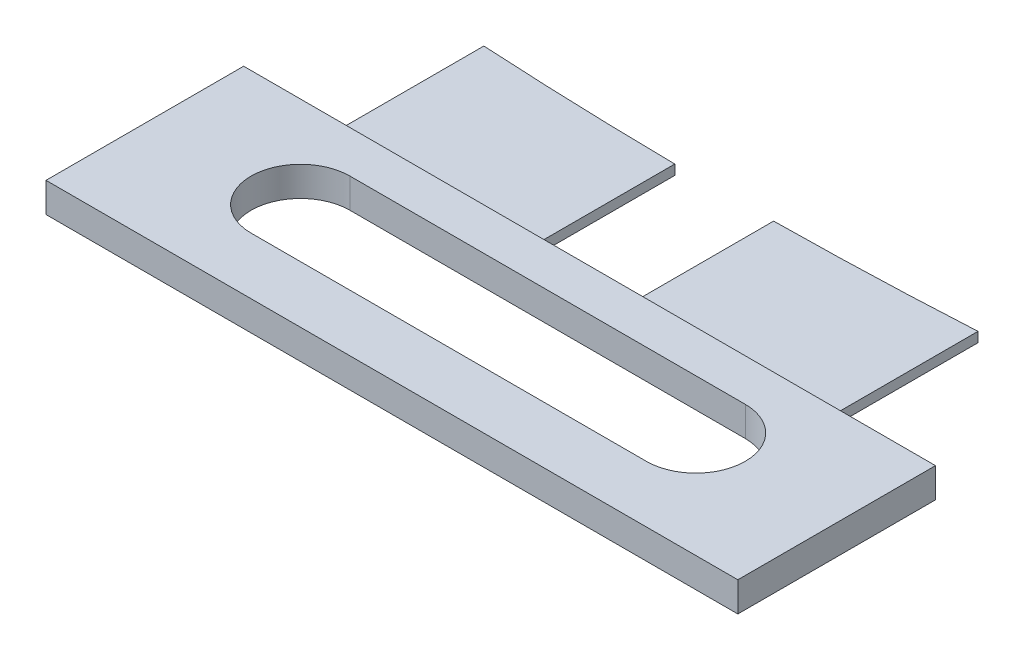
ISO-10303-21;
HEADER;
FILE_DESCRIPTION(('STEP AP214'),'2;1');
FILE_NAME('part.step','',(''),(''),'','','');
FILE_SCHEMA(('AUTOMOTIVE_DESIGN { 1 0 10303 214 1 1 1 1 }'));
ENDSEC;
DATA;
#1=APPLICATION_CONTEXT('core data for automotive mechanical design processes');
#2=APPLICATION_PROTOCOL_DEFINITION('international standard','automotive_design',2000,#1);
#3=PRODUCT_CONTEXT('',#1,'mechanical');
#4=PRODUCT('Part','Part','',(#3));
#5=PRODUCT_RELATED_PRODUCT_CATEGORY('part','',(#4));
#6=PRODUCT_DEFINITION_FORMATION('','',#4);
#7=PRODUCT_DEFINITION_CONTEXT('part definition',#1,'design');
#8=PRODUCT_DEFINITION('design','',#6,#7);
#9=PRODUCT_DEFINITION_SHAPE('','',#8);
#10=(LENGTH_UNIT() NAMED_UNIT(*) SI_UNIT(.MILLI.,.METRE.));
#11=(NAMED_UNIT(*) PLANE_ANGLE_UNIT() SI_UNIT($,.RADIAN.));
#12=(NAMED_UNIT(*) SI_UNIT($,.STERADIAN.) SOLID_ANGLE_UNIT());
#13=UNCERTAINTY_MEASURE_WITH_UNIT(LENGTH_MEASURE(1.E-05),#10,'distance_accuracy_value','');
#14=(GEOMETRIC_REPRESENTATION_CONTEXT(3) GLOBAL_UNCERTAINTY_ASSIGNED_CONTEXT((#13)) GLOBAL_UNIT_ASSIGNED_CONTEXT((#10,
#11,#12)) REPRESENTATION_CONTEXT('',''));
#15=CARTESIAN_POINT('',(0.,0.,0.));
#16=DIRECTION('',(0.,0.,1.));
#17=DIRECTION('',(1.,0.,0.));
#18=AXIS2_PLACEMENT_3D('',#15,#16,#17);
#19=CARTESIAN_POINT('',(25.,0.,25.7005587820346));
#20=CARTESIAN_POINT('',(25.,-0.333333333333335,25.7005587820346));
#21=CARTESIAN_POINT('',(25.0000000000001,-0.666666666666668,25.7005587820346));
#22=CARTESIAN_POINT('',(25.0000000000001,-1.,25.7005587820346));
#23=CARTESIAN_POINT('',(18.3078555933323,0.,26.0801202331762));
#24=CARTESIAN_POINT('',(18.3078555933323,-0.333333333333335,26.0801202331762));
#25=CARTESIAN_POINT('',(18.3078555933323,-0.666666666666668,26.0801202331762));
#26=CARTESIAN_POINT('',(18.3078555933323,-1.,26.0801202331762));
#27=CARTESIAN_POINT('',(11.7024739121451,0.,26.3045502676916));
#28=CARTESIAN_POINT('',(11.7024739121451,-0.333333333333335,26.3045502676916));
#29=CARTESIAN_POINT('',(11.7024739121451,-0.666666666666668,26.3045502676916));
#30=CARTESIAN_POINT('',(11.7024739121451,-1.,26.3045502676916));
#31=CARTESIAN_POINT('',(4.9999999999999,0.,26.3800956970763));
#32=CARTESIAN_POINT('',(4.99999999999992,-0.333333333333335,26.3800956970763));
#33=CARTESIAN_POINT('',(4.99999999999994,-0.666666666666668,26.3800956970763));
#34=CARTESIAN_POINT('',(4.99999999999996,-1.,26.3800956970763));
#35=B_SPLINE_SURFACE_WITH_KNOTS('',3,3,((#19,#20,#21,#22),(#23,#24,#25,#26),(#27,#28,#29,#30),
(#31,#32,#33,#34)),.UNSPECIFIED.,.F.,.F.,.F.,(4,4),(4,4),(0.,1.),(0.,1.),.UNSPECIFIED.);
#36=CARTESIAN_POINT('',(4.9999999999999,0.,26.3800956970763));
#37=CARTESIAN_POINT('',(11.7024739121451,0.,26.3045502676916));
#38=CARTESIAN_POINT('',(18.3078555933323,0.,26.0801202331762));
#39=CARTESIAN_POINT('',(25.,0.,25.7005587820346));
#40=B_SPLINE_CURVE_WITH_KNOTS('',3,(#36,#37,#38,#39),.UNSPECIFIED.,.F.,.F.,(4,4),(0.,1.),.UNSPECIFIED.);
#41=CARTESIAN_POINT('',(25.,0.,25.7005587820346));
#42=VERTEX_POINT('',#41);
#43=CARTESIAN_POINT('',(4.99999999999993,0.,26.3800956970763));
#44=VERTEX_POINT('',#43);
#45=EDGE_CURVE('E339',#42,#44,#40,.F.);
#46=DIRECTION('',(0.,-1.,0.));
#47=VECTOR('',#46,1.);
#48=CARTESIAN_POINT('',(25.,4.61643110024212,25.7005587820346));
#49=LINE('',#48,#47);
#50=CARTESIAN_POINT('',(25.,-1.,25.7005587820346));
#51=VERTEX_POINT('',#50);
#52=EDGE_CURVE('E365',#51,#42,#49,.F.);
#53=CARTESIAN_POINT('',(25.0000000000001,-1.,25.7005587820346));
#54=CARTESIAN_POINT('',(18.3078555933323,-1.,26.0801202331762));
#55=CARTESIAN_POINT('',(11.7024739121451,-1.,26.3045502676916));
#56=CARTESIAN_POINT('',(4.99999999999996,-1.,26.3800956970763));
#57=B_SPLINE_CURVE_WITH_KNOTS('',3,(#53,#54,#55,#56),.UNSPECIFIED.,.F.,.F.,(4,4),(0.,1.),.UNSPECIFIED.);
#58=CARTESIAN_POINT('',(4.99999999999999,-1.,26.3800956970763));
#59=VERTEX_POINT('',#58);
#60=EDGE_CURVE('E368',#59,#51,#57,.F.);
#61=DIRECTION('',(0.,-1.,0.));
#62=VECTOR('',#61,1.);
#63=CARTESIAN_POINT('',(4.99999999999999,4.61643110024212,26.3800956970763));
#64=LINE('',#63,#62);
#65=EDGE_CURVE('E367',#44,#59,#64,.T.);
#66=ORIENTED_EDGE('',*,*,#45,.F.);
#67=ORIENTED_EDGE('',*,*,#52,.F.);
#68=ORIENTED_EDGE('',*,*,#60,.F.);
#69=ORIENTED_EDGE('',*,*,#65,.F.);
#70=EDGE_LOOP('',(#66,#67,#68,#69));
#71=FACE_BOUND('',#70,.T.);
#72=ADVANCED_FACE('F32',(#71),#35,.F.);
#73=CARTESIAN_POINT('',(4.99999999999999,-1.,-37.5014306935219));
#74=DIRECTION('',(-1.,0.,0.));
#75=DIRECTION('',(0.,0.,1.));
#76=AXIS2_PLACEMENT_3D('',#73,#74,#75);
#77=PLANE('',#76);
#78=ORIENTED_EDGE('',*,*,#65,.T.);
#79=DIRECTION('',(0.,0.,1.));
#80=VECTOR('',#79,1.);
#81=CARTESIAN_POINT('',(4.99999999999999,-1.,-37.5014306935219));
#82=LINE('',#81,#80);
#83=CARTESIAN_POINT('',(4.99999999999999,-1.,40.));
#84=VERTEX_POINT('',#83);
#85=EDGE_CURVE('E419',#59,#84,#82,.T.);
#86=ORIENTED_EDGE('',*,*,#85,.T.);
#87=DIRECTION('',(0.,-1.,0.));
#88=VECTOR('',#87,1.);
#89=CARTESIAN_POINT('',(4.99999999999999,-1.,40.));
#90=LINE('',#89,#88);
#91=CARTESIAN_POINT('',(4.99999999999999,0.,40.));
#92=VERTEX_POINT('',#91);
#93=EDGE_CURVE('E338',#92,#84,#90,.T.);
#94=ORIENTED_EDGE('',*,*,#93,.F.);
#95=DIRECTION('',(0.,0.,1.));
#96=VECTOR('',#95,1.);
#97=CARTESIAN_POINT('',(4.99999999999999,0.,-37.5014306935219));
#98=LINE('',#97,#96);
#99=EDGE_CURVE('E348',#44,#92,#98,.T.);
#100=ORIENTED_EDGE('',*,*,#99,.F.);
#101=EDGE_LOOP('',(#78,#86,#94,#100));
#102=FACE_BOUND('',#101,.T.);
#103=ADVANCED_FACE('F310',(#102),#77,.T.);
#104=CARTESIAN_POINT('',(25.,-1.,-37.5014306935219));
#105=DIRECTION('',(0.,-1.,0.));
#106=DIRECTION('',(0.,0.,-1.));
#107=AXIS2_PLACEMENT_3D('',#104,#105,#106);
#108=PLANE('',#107);
#109=ORIENTED_EDGE('',*,*,#60,.T.);
#110=DIRECTION('',(0.,0.,1.));
#111=VECTOR('',#110,1.);
#112=CARTESIAN_POINT('',(25.,-1.,-37.5014306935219));
#113=LINE('',#112,#111);
#114=CARTESIAN_POINT('',(25.,-1.,40.));
#115=VERTEX_POINT('',#114);
#116=EDGE_CURVE('E43',#51,#115,#113,.T.);
#117=ORIENTED_EDGE('',*,*,#116,.T.);
#118=DIRECTION('',(1.,0.,0.));
#119=VECTOR('',#118,1.);
#120=CARTESIAN_POINT('',(25.,-1.,40.));
#121=LINE('',#120,#119);
#122=EDGE_CURVE('E342',#84,#115,#121,.T.);
#123=ORIENTED_EDGE('',*,*,#122,.F.);
#124=ORIENTED_EDGE('',*,*,#85,.F.);
#125=EDGE_LOOP('',(#109,#117,#123,#124));
#126=FACE_BOUND('',#125,.T.);
#127=ADVANCED_FACE('F423',(#126),#108,.T.);
#128=CARTESIAN_POINT('',(25.,0.,-37.5014306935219));
#129=DIRECTION('',(1.,0.,0.));
#130=DIRECTION('',(0.,1.,0.));
#131=AXIS2_PLACEMENT_3D('',#128,#129,#130);
#132=PLANE('',#131);
#133=ORIENTED_EDGE('',*,*,#52,.T.);
#134=DIRECTION('',(0.,0.,1.));
#135=VECTOR('',#134,1.);
#136=CARTESIAN_POINT('',(25.,0.,-37.5014306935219));
#137=LINE('',#136,#135);
#138=CARTESIAN_POINT('',(25.,0.,40.));
#139=VERTEX_POINT('',#138);
#140=EDGE_CURVE('E11',#42,#139,#137,.T.);
#141=ORIENTED_EDGE('',*,*,#140,.T.);
#142=DIRECTION('',(0.,1.,0.));
#143=VECTOR('',#142,1.);
#144=CARTESIAN_POINT('',(25.,0.,40.));
#145=LINE('',#144,#143);
#146=EDGE_CURVE('E345',#115,#139,#145,.T.);
#147=ORIENTED_EDGE('',*,*,#146,.F.);
#148=ORIENTED_EDGE('',*,*,#116,.F.);
#149=EDGE_LOOP('',(#133,#141,#147,#148));
#150=FACE_BOUND('',#149,.T.);
#151=ADVANCED_FACE('F312',(#150),#132,.T.);
#152=CARTESIAN_POINT('',(4.99999999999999,0.,-37.5014306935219));
#153=DIRECTION('',(0.,1.,0.));
#154=DIRECTION('',(-1.,0.,0.));
#155=AXIS2_PLACEMENT_3D('',#152,#153,#154);
#156=PLANE('',#155);
#157=ORIENTED_EDGE('',*,*,#45,.T.);
#158=ORIENTED_EDGE('',*,*,#99,.T.);
#159=DIRECTION('',(-1.,0.,0.));
#160=VECTOR('',#159,1.);
#161=CARTESIAN_POINT('',(4.99999999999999,0.,40.));
#162=LINE('',#161,#160);
#163=EDGE_CURVE('E330',#139,#92,#162,.T.);
#164=ORIENTED_EDGE('',*,*,#163,.F.);
#165=ORIENTED_EDGE('',*,*,#140,.F.);
#166=EDGE_LOOP('',(#157,#158,#164,#165));
#167=FACE_BOUND('',#166,.T.);
#168=ADVANCED_FACE('F34',(#167),#156,.T.);
#169=CARTESIAN_POINT('',(-35.,0.382289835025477,60.));
#170=DIRECTION('',(1.,0.,0.));
#171=DIRECTION('',(0.,0.,-1.));
#172=AXIS2_PLACEMENT_3D('',#169,#170,#171);
#173=PLANE('',#172);
#174=DIRECTION('',(0.,-1.,0.));
#175=VECTOR('',#174,1.);
#176=CARTESIAN_POINT('',(-35.,0.382289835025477,40.));
#177=LINE('',#176,#175);
#178=CARTESIAN_POINT('',(-35.,0.382289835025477,40.));
#179=VERTEX_POINT('',#178);
#180=CARTESIAN_POINT('',(-35.,-2.61771016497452,40.));
#181=VERTEX_POINT('',#180);
#182=EDGE_CURVE('E259',#179,#181,#177,.T.);
#183=ORIENTED_EDGE('',*,*,#182,.T.);
#184=DIRECTION('',(0.,0.,-1.));
#185=VECTOR('',#184,1.);
#186=CARTESIAN_POINT('',(-35.,-2.61771016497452,60.));
#187=LINE('',#186,#185);
#188=CARTESIAN_POINT('',(-35.,-2.61771016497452,60.));
#189=VERTEX_POINT('',#188);
#190=EDGE_CURVE('E370',#189,#181,#187,.T.);
#191=ORIENTED_EDGE('',*,*,#190,.F.);
#192=DIRECTION('',(0.,-1.,0.));
#193=VECTOR('',#192,1.);
#194=CARTESIAN_POINT('',(-35.,0.382289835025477,60.));
#195=LINE('',#194,#193);
#196=CARTESIAN_POINT('',(-35.,0.382289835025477,60.));
#197=VERTEX_POINT('',#196);
#198=EDGE_CURVE('E272',#197,#189,#195,.T.);
#199=ORIENTED_EDGE('',*,*,#198,.F.);
#200=DIRECTION('',(0.,0.,-1.));
#201=VECTOR('',#200,1.);
#202=CARTESIAN_POINT('',(-35.,0.382289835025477,60.));
#203=LINE('',#202,#201);
#204=EDGE_CURVE('E386',#197,#179,#203,.T.);
#205=ORIENTED_EDGE('',*,*,#204,.T.);
#206=EDGE_LOOP('',(#183,#191,#199,#205));
#207=FACE_BOUND('',#206,.T.);
#208=ADVANCED_FACE('F301',(#207),#173,.F.);
#209=CARTESIAN_POINT('',(-35.,-2.61771016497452,60.));
#210=DIRECTION('',(0.,1.,0.));
#211=DIRECTION('',(0.,0.,1.));
#212=AXIS2_PLACEMENT_3D('',#209,#210,#211);
#213=PLANE('',#212);
#214=DIRECTION('',(-1.,0.,0.));
#215=VECTOR('',#214,1.);
#216=CARTESIAN_POINT('',(-20.,-2.61771016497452,44.2497229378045));
#217=LINE('',#216,#215);
#218=CARTESIAN_POINT('',(20.,-2.61771016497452,44.2497229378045));
#219=VERTEX_POINT('',#218);
#220=CARTESIAN_POINT('',(-20.,-2.61771016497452,44.2497229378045));
#221=VERTEX_POINT('',#220);
#222=EDGE_CURVE('E156',#219,#221,#217,.T.);
#223=ORIENTED_EDGE('',*,*,#222,.T.);
#224=CARTESIAN_POINT('',(-20.,-2.61771016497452,49.2497229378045));
#225=DIRECTION('',(0.,1.,0.));
#226=DIRECTION('',(0.,0.,1.));
#227=AXIS2_PLACEMENT_3D('',#224,#225,#226);
#228=CIRCLE('',#227,5.);
#229=CARTESIAN_POINT('',(-20.,-2.61771016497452,54.2497229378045));
#230=VERTEX_POINT('',#229);
#231=EDGE_CURVE('E150',#221,#230,#228,.T.);
#232=ORIENTED_EDGE('',*,*,#231,.T.);
#233=DIRECTION('',(1.,0.,0.));
#234=VECTOR('',#233,1.);
#235=CARTESIAN_POINT('',(-20.,-2.61771016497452,54.2497229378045));
#236=LINE('',#235,#234);
#237=CARTESIAN_POINT('',(20.,-2.61771016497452,54.2497229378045));
#238=VERTEX_POINT('',#237);
#239=EDGE_CURVE('E159',#230,#238,#236,.T.);
#240=ORIENTED_EDGE('',*,*,#239,.T.);
#241=CARTESIAN_POINT('',(20.,-2.61771016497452,49.2497229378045));
#242=DIRECTION('',(0.,1.,0.));
#243=DIRECTION('',(0.,0.,1.));
#244=AXIS2_PLACEMENT_3D('',#241,#242,#243);
#245=CIRCLE('',#244,5.);
#246=EDGE_CURVE('E51',#238,#219,#245,.T.);
#247=ORIENTED_EDGE('',*,*,#246,.T.);
#248=EDGE_LOOP('',(#223,#232,#240,#247));
#249=FACE_BOUND('',#248,.T.);
#250=DIRECTION('',(1.,0.,0.));
#251=VECTOR('',#250,1.);
#252=CARTESIAN_POINT('',(-35.,-2.61771016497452,40.));
#253=LINE('',#252,#251);
#254=CARTESIAN_POINT('',(35.,-2.61771016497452,40.));
#255=VERTEX_POINT('',#254);
#256=EDGE_CURVE('E394',#181,#255,#253,.T.);
#257=ORIENTED_EDGE('',*,*,#256,.T.);
#258=DIRECTION('',(0.,0.,-1.));
#259=VECTOR('',#258,1.);
#260=CARTESIAN_POINT('',(35.,-2.61771016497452,60.));
#261=LINE('',#260,#259);
#262=CARTESIAN_POINT('',(35.,-2.61771016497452,60.));
#263=VERTEX_POINT('',#262);
#264=EDGE_CURVE('E373',#263,#255,#261,.T.);
#265=ORIENTED_EDGE('',*,*,#264,.F.);
#266=DIRECTION('',(1.,0.,0.));
#267=VECTOR('',#266,1.);
#268=CARTESIAN_POINT('',(-35.,-2.61771016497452,60.));
#269=LINE('',#268,#267);
#270=EDGE_CURVE('E400',#189,#263,#269,.T.);
#271=ORIENTED_EDGE('',*,*,#270,.F.);
#272=ORIENTED_EDGE('',*,*,#190,.T.);
#273=EDGE_LOOP('',(#257,#265,#271,#272));
#274=FACE_BOUND('',#273,.T.);
#275=ADVANCED_FACE('F163',(#249,#274),#213,.F.);
#276=CARTESIAN_POINT('',(35.,0.382289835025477,60.));
#277=DIRECTION('',(-1.,0.,0.));
#278=DIRECTION('',(0.,0.,1.));
#279=AXIS2_PLACEMENT_3D('',#276,#277,#278);
#280=PLANE('',#279);
#281=DIRECTION('',(0.,1.,0.));
#282=VECTOR('',#281,1.);
#283=CARTESIAN_POINT('',(35.,0.382289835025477,40.));
#284=LINE('',#283,#282);
#285=CARTESIAN_POINT('',(35.,0.382289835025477,40.));
#286=VERTEX_POINT('',#285);
#287=EDGE_CURVE('E392',#255,#286,#284,.T.);
#288=ORIENTED_EDGE('',*,*,#287,.T.);
#289=DIRECTION('',(0.,0.,-1.));
#290=VECTOR('',#289,1.);
#291=CARTESIAN_POINT('',(35.,0.382289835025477,60.));
#292=LINE('',#291,#290);
#293=CARTESIAN_POINT('',(35.,0.382289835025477,60.));
#294=VERTEX_POINT('',#293);
#295=EDGE_CURVE('E383',#294,#286,#292,.T.);
#296=ORIENTED_EDGE('',*,*,#295,.F.);
#297=DIRECTION('',(0.,1.,0.));
#298=VECTOR('',#297,1.);
#299=CARTESIAN_POINT('',(35.,0.382289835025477,60.));
#300=LINE('',#299,#298);
#301=EDGE_CURVE('E399',#263,#294,#300,.T.);
#302=ORIENTED_EDGE('',*,*,#301,.F.);
#303=ORIENTED_EDGE('',*,*,#264,.T.);
#304=EDGE_LOOP('',(#288,#296,#302,#303));
#305=FACE_BOUND('',#304,.T.);
#306=ADVANCED_FACE('F294',(#305),#280,.F.);
#307=CARTESIAN_POINT('',(-35.,0.382289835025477,60.));
#308=DIRECTION('',(0.,-1.,0.));
#309=DIRECTION('',(0.,0.,-1.));
#310=AXIS2_PLACEMENT_3D('',#307,#308,#309);
#311=PLANE('',#310);
#312=DIRECTION('',(1.,0.,0.));
#313=VECTOR('',#312,1.);
#314=CARTESIAN_POINT('',(-20.,0.382289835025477,54.2497229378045));
#315=LINE('',#314,#313);
#316=CARTESIAN_POINT('',(-20.,0.382289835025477,54.2497229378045));
#317=VERTEX_POINT('',#316);
#318=CARTESIAN_POINT('',(20.,0.382289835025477,54.2497229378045));
#319=VERTEX_POINT('',#318);
#320=EDGE_CURVE('E175',#317,#319,#315,.T.);
#321=ORIENTED_EDGE('',*,*,#320,.F.);
#322=CARTESIAN_POINT('',(-20.,0.382289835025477,49.2497229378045));
#323=DIRECTION('',(0.,1.,0.));
#324=DIRECTION('',(0.,0.,1.));
#325=AXIS2_PLACEMENT_3D('',#322,#323,#324);
#326=CIRCLE('',#325,5.);
#327=CARTESIAN_POINT('',(-20.,0.382289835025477,44.2497229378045));
#328=VERTEX_POINT('',#327);
#329=EDGE_CURVE('E59',#328,#317,#326,.T.);
#330=ORIENTED_EDGE('',*,*,#329,.F.);
#331=DIRECTION('',(-1.,0.,0.));
#332=VECTOR('',#331,1.);
#333=CARTESIAN_POINT('',(-20.,0.382289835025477,44.2497229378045));
#334=LINE('',#333,#332);
#335=CARTESIAN_POINT('',(20.,0.382289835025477,44.2497229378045));
#336=VERTEX_POINT('',#335);
#337=EDGE_CURVE('E166',#336,#328,#334,.T.);
#338=ORIENTED_EDGE('',*,*,#337,.F.);
#339=CARTESIAN_POINT('',(20.,0.382289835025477,49.2497229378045));
#340=DIRECTION('',(0.,1.,0.));
#341=DIRECTION('',(0.,0.,1.));
#342=AXIS2_PLACEMENT_3D('',#339,#340,#341);
#343=CIRCLE('',#342,5.);
#344=EDGE_CURVE('E169',#319,#336,#343,.T.);
#345=ORIENTED_EDGE('',*,*,#344,.F.);
#346=EDGE_LOOP('',(#321,#330,#338,#345));
#347=FACE_BOUND('',#346,.T.);
#348=DIRECTION('',(-1.,0.,0.));
#349=VECTOR('',#348,1.);
#350=CARTESIAN_POINT('',(-35.,0.382289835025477,40.));
#351=LINE('',#350,#349);
#352=EDGE_CURVE('E390',#286,#179,#351,.T.);
#353=ORIENTED_EDGE('',*,*,#352,.T.);
#354=ORIENTED_EDGE('',*,*,#204,.F.);
#355=DIRECTION('',(-1.,0.,0.));
#356=VECTOR('',#355,1.);
#357=CARTESIAN_POINT('',(-35.,0.382289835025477,60.));
#358=LINE('',#357,#356);
#359=EDGE_CURVE('E389',#294,#197,#358,.T.);
#360=ORIENTED_EDGE('',*,*,#359,.F.);
#361=ORIENTED_EDGE('',*,*,#295,.T.);
#362=EDGE_LOOP('',(#353,#354,#360,#361));
#363=FACE_BOUND('',#362,.T.);
#364=ADVANCED_FACE('F287',(#347,#363),#311,.F.);
#365=CARTESIAN_POINT('',(0.,0.,60.));
#366=DIRECTION('',(0.,0.,1.));
#367=DIRECTION('',(1.,0.,0.));
#368=AXIS2_PLACEMENT_3D('',#365,#366,#367);
#369=PLANE('',#368);
#370=ORIENTED_EDGE('',*,*,#198,.T.);
#371=ORIENTED_EDGE('',*,*,#270,.T.);
#372=ORIENTED_EDGE('',*,*,#301,.T.);
#373=ORIENTED_EDGE('',*,*,#359,.T.);
#374=EDGE_LOOP('',(#370,#371,#372,#373));
#375=FACE_BOUND('',#374,.T.);
#376=ADVANCED_FACE('F284',(#375),#369,.T.);
#377=CARTESIAN_POINT('',(0.,0.,40.));
#378=DIRECTION('',(0.,0.,1.));
#379=DIRECTION('',(1.,0.,0.));
#380=AXIS2_PLACEMENT_3D('',#377,#378,#379);
#381=PLANE('',#380);
#382=DIRECTION('',(-1.,0.,0.));
#383=VECTOR('',#382,1.);
#384=CARTESIAN_POINT('',(-25.,0.,40.));
#385=LINE('',#384,#383);
#386=CARTESIAN_POINT('',(-5.00000000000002,0.,40.));
#387=VERTEX_POINT('',#386);
#388=CARTESIAN_POINT('',(-25.,0.,40.));
#389=VERTEX_POINT('',#388);
#390=EDGE_CURVE('E233',#387,#389,#385,.T.);
#391=ORIENTED_EDGE('',*,*,#390,.T.);
#392=DIRECTION('',(0.,-1.,0.));
#393=VECTOR('',#392,1.);
#394=CARTESIAN_POINT('',(-25.,-1.,40.));
#395=LINE('',#394,#393);
#396=CARTESIAN_POINT('',(-25.,-1.,40.));
#397=VERTEX_POINT('',#396);
#398=EDGE_CURVE('E241',#389,#397,#395,.T.);
#399=ORIENTED_EDGE('',*,*,#398,.T.);
#400=DIRECTION('',(1.,0.,0.));
#401=VECTOR('',#400,1.);
#402=CARTESIAN_POINT('',(-4.99999999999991,-1.,40.));
#403=LINE('',#402,#401);
#404=CARTESIAN_POINT('',(-4.99999999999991,-1.,40.));
#405=VERTEX_POINT('',#404);
#406=EDGE_CURVE('E244',#397,#405,#403,.T.);
#407=ORIENTED_EDGE('',*,*,#406,.T.);
#408=DIRECTION('',(-1.05818132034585E-13,1.,0.));
#409=VECTOR('',#408,1.);
#410=CARTESIAN_POINT('',(-5.00000000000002,0.,40.));
#411=LINE('',#410,#409);
#412=EDGE_CURVE('E247',#405,#387,#411,.T.);
#413=ORIENTED_EDGE('',*,*,#412,.T.);
#414=EDGE_LOOP('',(#391,#399,#407,#413));
#415=FACE_BOUND('',#414,.T.);
#416=ORIENTED_EDGE('',*,*,#93,.T.);
#417=ORIENTED_EDGE('',*,*,#122,.T.);
#418=ORIENTED_EDGE('',*,*,#146,.T.);
#419=ORIENTED_EDGE('',*,*,#163,.T.);
#420=EDGE_LOOP('',(#416,#417,#418,#419));
#421=FACE_BOUND('',#420,.T.);
#422=ORIENTED_EDGE('',*,*,#182,.F.);
#423=ORIENTED_EDGE('',*,*,#352,.F.);
#424=ORIENTED_EDGE('',*,*,#287,.F.);
#425=ORIENTED_EDGE('',*,*,#256,.F.);
#426=EDGE_LOOP('',(#422,#423,#424,#425));
#427=FACE_BOUND('',#426,.T.);
#428=ADVANCED_FACE('F220',(#415,#421,#427),#381,.F.);
#429=CARTESIAN_POINT('',(-4.9999999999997,0.,26.3794115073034));
#430=CARTESIAN_POINT('',(-4.99999999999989,-0.333333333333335,26.3794115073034));
#431=CARTESIAN_POINT('',(-5.00000000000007,-0.666666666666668,26.3794115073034));
#432=CARTESIAN_POINT('',(-5.00000000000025,-1.,26.3794115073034));
#433=CARTESIAN_POINT('',(-11.7024945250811,0.,26.3029485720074));
#434=CARTESIAN_POINT('',(-11.7024945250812,-0.333333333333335,26.3029485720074));
#435=CARTESIAN_POINT('',(-11.7024945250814,-0.666666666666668,26.3029485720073));
#436=CARTESIAN_POINT('',(-11.7024945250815,-1.,26.3029485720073));
#437=CARTESIAN_POINT('',(-18.3078767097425,0.,26.0776129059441));
#438=CARTESIAN_POINT('',(-18.3078767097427,-0.333333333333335,26.0776129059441));
#439=CARTESIAN_POINT('',(-18.3078767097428,-0.666666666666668,26.0776129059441));
#440=CARTESIAN_POINT('',(-18.307876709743,-1.,26.0776129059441));
#441=CARTESIAN_POINT('',(-24.9999999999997,0.,25.6971325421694));
#442=CARTESIAN_POINT('',(-24.9999999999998,-0.333333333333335,25.6971325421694));
#443=CARTESIAN_POINT('',(-24.9999999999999,-0.666666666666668,25.6971325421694));
#444=CARTESIAN_POINT('',(-25.,-1.,25.6971325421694));
#445=B_SPLINE_SURFACE_WITH_KNOTS('',3,3,((#429,#430,#431,#432),(#433,#434,#435,#436),(#437,#438,
#439,#440),(#441,#442,#443,#444)),.UNSPECIFIED.,.F.,.F.,.F.,(4,4),(4,4),(0.,1.),(0.,1.),.UNSPECIFIED.);
#446=CARTESIAN_POINT('',(-24.9999999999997,0.,25.6971325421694));
#447=CARTESIAN_POINT('',(-18.3078767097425,0.,26.0776129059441));
#448=CARTESIAN_POINT('',(-11.7024945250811,0.,26.3029485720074));
#449=CARTESIAN_POINT('',(-4.9999999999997,0.,26.3794115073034));
#450=B_SPLINE_CURVE_WITH_KNOTS('',3,(#446,#447,#448,#449),.UNSPECIFIED.,.F.,.F.,(4,4),(0.,1.),.UNSPECIFIED.);
#451=CARTESIAN_POINT('',(-5.00000000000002,0.,26.3794115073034));
#452=VERTEX_POINT('',#451);
#453=CARTESIAN_POINT('',(-24.9999999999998,0.,25.6971325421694));
#454=VERTEX_POINT('',#453);
#455=EDGE_CURVE('E187',#452,#454,#450,.F.);
#456=DIRECTION('',(0.,-1.,0.));
#457=VECTOR('',#456,1.);
#458=CARTESIAN_POINT('',(-5.00000000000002,4.61643110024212,26.3794115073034));
#459=LINE('',#458,#457);
#460=CARTESIAN_POINT('',(-4.99999999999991,-1.,26.3794115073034));
#461=VERTEX_POINT('',#460);
#462=EDGE_CURVE('E185',#461,#452,#459,.F.);
#463=CARTESIAN_POINT('',(-5.00000000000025,-1.,26.3794115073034));
#464=CARTESIAN_POINT('',(-11.7024945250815,-1.,26.3029485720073));
#465=CARTESIAN_POINT('',(-18.307876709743,-1.,26.0776129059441));
#466=CARTESIAN_POINT('',(-25.,-1.,25.6971325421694));
#467=B_SPLINE_CURVE_WITH_KNOTS('',3,(#463,#464,#465,#466),.UNSPECIFIED.,.F.,.F.,(4,4),(0.,1.),.UNSPECIFIED.);
#468=CARTESIAN_POINT('',(-25.,-1.,25.6971325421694));
#469=VERTEX_POINT('',#468);
#470=EDGE_CURVE('E188',#469,#461,#467,.F.);
#471=DIRECTION('',(0.,-1.,0.));
#472=VECTOR('',#471,1.);
#473=CARTESIAN_POINT('',(-25.,4.61643110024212,25.6971325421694));
#474=LINE('',#473,#472);
#475=EDGE_CURVE('E181',#454,#469,#474,.T.);
#476=ORIENTED_EDGE('',*,*,#455,.F.);
#477=ORIENTED_EDGE('',*,*,#462,.F.);
#478=ORIENTED_EDGE('',*,*,#470,.F.);
#479=ORIENTED_EDGE('',*,*,#475,.F.);
#480=EDGE_LOOP('',(#476,#477,#478,#479));
#481=FACE_BOUND('',#480,.T.);
#482=ADVANCED_FACE('F207',(#481),#445,.F.);
#483=CARTESIAN_POINT('',(-25.,-1.,-37.5014306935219));
#484=DIRECTION('',(-1.,0.,0.));
#485=DIRECTION('',(0.,0.,1.));
#486=AXIS2_PLACEMENT_3D('',#483,#484,#485);
#487=PLANE('',#486);
#488=ORIENTED_EDGE('',*,*,#475,.T.);
#489=DIRECTION('',(0.,0.,1.));
#490=VECTOR('',#489,1.);
#491=CARTESIAN_POINT('',(-25.,-1.,-37.5014306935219));
#492=LINE('',#491,#490);
#493=EDGE_CURVE('E575',#469,#397,#492,.T.);
#494=ORIENTED_EDGE('',*,*,#493,.T.);
#495=ORIENTED_EDGE('',*,*,#398,.F.);
#496=DIRECTION('',(0.,0.,1.));
#497=VECTOR('',#496,1.);
#498=CARTESIAN_POINT('',(-25.,0.,-37.5014306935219));
#499=LINE('',#498,#497);
#500=EDGE_CURVE('E250',#454,#389,#499,.T.);
#501=ORIENTED_EDGE('',*,*,#500,.F.);
#502=EDGE_LOOP('',(#488,#494,#495,#501));
#503=FACE_BOUND('',#502,.T.);
#504=ADVANCED_FACE('F219',(#503),#487,.T.);
#505=CARTESIAN_POINT('',(-4.99999999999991,-1.,-37.5014306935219));
#506=DIRECTION('',(0.,-1.,0.));
#507=DIRECTION('',(1.,0.,0.));
#508=AXIS2_PLACEMENT_3D('',#505,#506,#507);
#509=PLANE('',#508);
#510=ORIENTED_EDGE('',*,*,#470,.T.);
#511=DIRECTION('',(0.,0.,1.));
#512=VECTOR('',#511,1.);
#513=CARTESIAN_POINT('',(-4.99999999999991,-1.,-37.5014306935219));
#514=LINE('',#513,#512);
#515=EDGE_CURVE('E260',#461,#405,#514,.T.);
#516=ORIENTED_EDGE('',*,*,#515,.T.);
#517=ORIENTED_EDGE('',*,*,#406,.F.);
#518=ORIENTED_EDGE('',*,*,#493,.F.);
#519=EDGE_LOOP('',(#510,#516,#517,#518));
#520=FACE_BOUND('',#519,.T.);
#521=ADVANCED_FACE('F477',(#520),#509,.T.);
#522=CARTESIAN_POINT('',(-5.00000000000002,0.,-37.5014306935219));
#523=DIRECTION('',(1.,1.05818132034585E-13,0.));
#524=DIRECTION('',(-1.05818132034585E-13,1.,0.));
#525=AXIS2_PLACEMENT_3D('',#522,#523,#524);
#526=PLANE('',#525);
#527=ORIENTED_EDGE('',*,*,#462,.T.);
#528=DIRECTION('',(0.,0.,1.));
#529=VECTOR('',#528,1.);
#530=CARTESIAN_POINT('',(-5.00000000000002,0.,-37.5014306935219));
#531=LINE('',#530,#529);
#532=EDGE_CURVE('E256',#452,#387,#531,.T.);
#533=ORIENTED_EDGE('',*,*,#532,.T.);
#534=ORIENTED_EDGE('',*,*,#412,.F.);
#535=ORIENTED_EDGE('',*,*,#515,.F.);
#536=EDGE_LOOP('',(#527,#533,#534,#535));
#537=FACE_BOUND('',#536,.T.);
#538=ADVANCED_FACE('F222',(#537),#526,.T.);
#539=CARTESIAN_POINT('',(-25.,0.,-37.5014306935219));
#540=DIRECTION('',(0.,1.,0.));
#541=DIRECTION('',(0.,0.,1.));
#542=AXIS2_PLACEMENT_3D('',#539,#540,#541);
#543=PLANE('',#542);
#544=ORIENTED_EDGE('',*,*,#455,.T.);
#545=ORIENTED_EDGE('',*,*,#500,.T.);
#546=ORIENTED_EDGE('',*,*,#390,.F.);
#547=ORIENTED_EDGE('',*,*,#532,.F.);
#548=EDGE_LOOP('',(#544,#545,#546,#547));
#549=FACE_BOUND('',#548,.T.);
#550=ADVANCED_FACE('F274',(#549),#543,.T.);
#551=CARTESIAN_POINT('',(-20.,-2.61771016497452,49.2497229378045));
#552=DIRECTION('',(0.,1.,0.));
#553=DIRECTION('',(0.,0.,1.));
#554=AXIS2_PLACEMENT_3D('',#551,#552,#553);
#555=CYLINDRICAL_SURFACE('',#554,5.);
#556=ORIENTED_EDGE('',*,*,#329,.T.);
#557=DIRECTION('',(0.,1.,0.));
#558=VECTOR('',#557,1.);
#559=CARTESIAN_POINT('',(-20.,-2.61771016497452,54.2497229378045));
#560=LINE('',#559,#558);
#561=EDGE_CURVE('E146',#230,#317,#560,.T.);
#562=ORIENTED_EDGE('',*,*,#561,.F.);
#563=ORIENTED_EDGE('',*,*,#231,.F.);
#564=DIRECTION('',(0.,1.,0.));
#565=VECTOR('',#564,1.);
#566=CARTESIAN_POINT('',(-20.,-2.61771016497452,44.2497229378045));
#567=LINE('',#566,#565);
#568=EDGE_CURVE('E179',#221,#328,#567,.T.);
#569=ORIENTED_EDGE('',*,*,#568,.T.);
#570=EDGE_LOOP('',(#556,#562,#563,#569));
#571=FACE_BOUND('',#570,.T.);
#572=ADVANCED_FACE('F148',(#571),#555,.F.);
#573=CARTESIAN_POINT('',(-20.,-2.61771016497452,44.2497229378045));
#574=DIRECTION('',(0.,0.,-1.));
#575=DIRECTION('',(-1.,0.,0.));
#576=AXIS2_PLACEMENT_3D('',#573,#574,#575);
#577=PLANE('',#576);
#578=ORIENTED_EDGE('',*,*,#337,.T.);
#579=ORIENTED_EDGE('',*,*,#568,.F.);
#580=ORIENTED_EDGE('',*,*,#222,.F.);
#581=DIRECTION('',(0.,1.,0.));
#582=VECTOR('',#581,1.);
#583=CARTESIAN_POINT('',(20.,-2.61771016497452,44.2497229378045));
#584=LINE('',#583,#582);
#585=EDGE_CURVE('E182',#219,#336,#584,.T.);
#586=ORIENTED_EDGE('',*,*,#585,.T.);
#587=EDGE_LOOP('',(#578,#579,#580,#586));
#588=FACE_BOUND('',#587,.T.);
#589=ADVANCED_FACE('F498',(#588),#577,.F.);
#590=CARTESIAN_POINT('',(20.,-2.61771016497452,49.2497229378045));
#591=DIRECTION('',(0.,1.,0.));
#592=DIRECTION('',(0.,0.,1.));
#593=AXIS2_PLACEMENT_3D('',#590,#591,#592);
#594=CYLINDRICAL_SURFACE('',#593,5.);
#595=ORIENTED_EDGE('',*,*,#344,.T.);
#596=ORIENTED_EDGE('',*,*,#585,.F.);
#597=ORIENTED_EDGE('',*,*,#246,.F.);
#598=DIRECTION('',(0.,1.,0.));
#599=VECTOR('',#598,1.);
#600=CARTESIAN_POINT('',(20.,-2.61771016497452,54.2497229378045));
#601=LINE('',#600,#599);
#602=EDGE_CURVE('E155',#238,#319,#601,.T.);
#603=ORIENTED_EDGE('',*,*,#602,.T.);
#604=EDGE_LOOP('',(#595,#596,#597,#603));
#605=FACE_BOUND('',#604,.T.);
#606=ADVANCED_FACE('F504',(#605),#594,.F.);
#607=CARTESIAN_POINT('',(-20.,-2.61771016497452,54.2497229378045));
#608=DIRECTION('',(0.,0.,1.));
#609=DIRECTION('',(1.,0.,0.));
#610=AXIS2_PLACEMENT_3D('',#607,#608,#609);
#611=PLANE('',#610);
#612=ORIENTED_EDGE('',*,*,#320,.T.);
#613=ORIENTED_EDGE('',*,*,#602,.F.);
#614=ORIENTED_EDGE('',*,*,#239,.F.);
#615=ORIENTED_EDGE('',*,*,#561,.T.);
#616=EDGE_LOOP('',(#612,#613,#614,#615));
#617=FACE_BOUND('',#616,.T.);
#618=ADVANCED_FACE('F160',(#617),#611,.F.);
#619=CLOSED_SHELL('',(#72,#103,#127,#151,#168,#208,#275,#306,#364,#376,#428,#482,#504,#521,#538,
#550,#572,#589,#606,#618));
#620=MANIFOLD_SOLID_BREP('B2',#619);
#621=ADVANCED_BREP_SHAPE_REPRESENTATION('',(#18,#620),#14);
#622=SHAPE_DEFINITION_REPRESENTATION(#9,#621);
ENDSEC;
END-ISO-10303-21;
